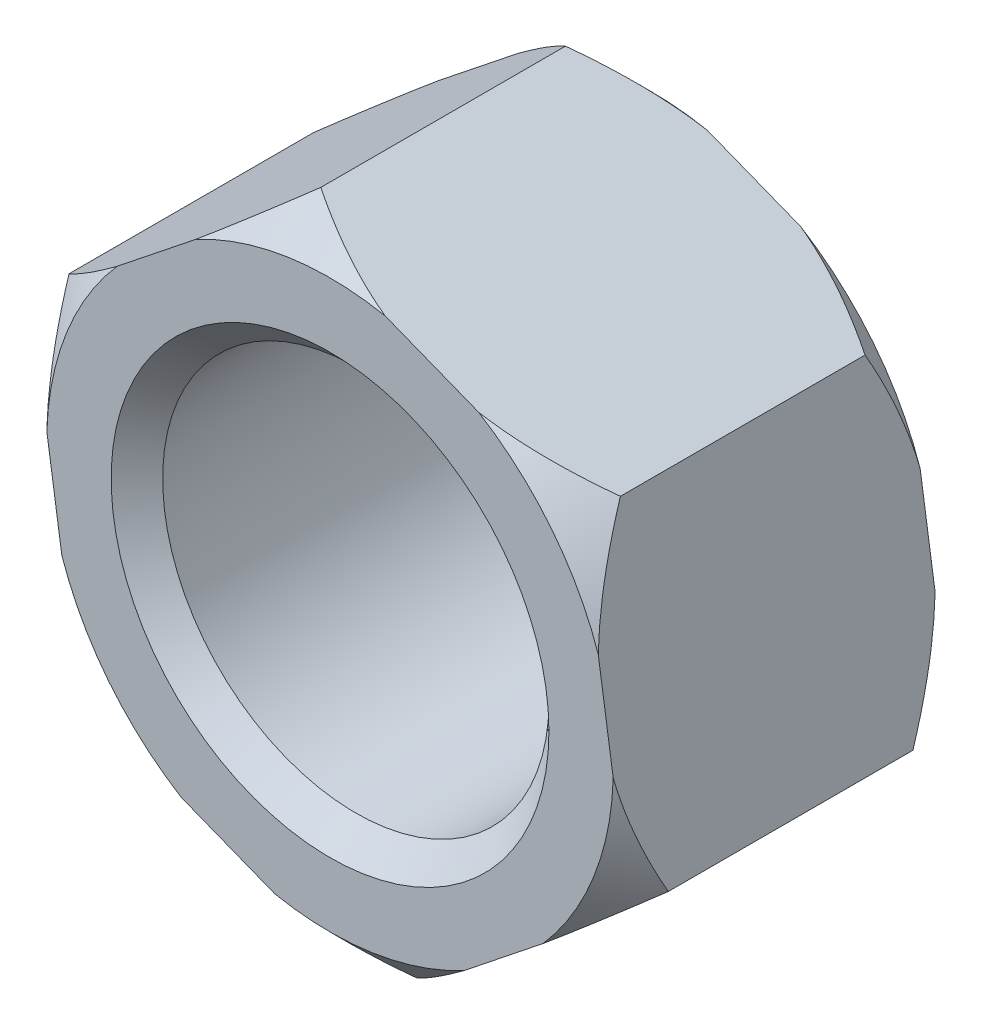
from build123d import *

# Parameters (mm, degrees)
ESQUISSE1_R                  = 2.5
BOSS_EXTRU_1_DEPTH           = 2.5
CHANFREIN1_SIZE              = 0.3
ESQUISSE2_R                  = 1.5
ENL_V_MAT_EXTRU_1_DEPTH      = 5.330127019
CHANFREIN2_SIZE              = 0.2
ENL_V_START                  = -5
ENL_V_MAT_EXTRU_2_DEPTH      = 5
R_P_TITION_CIRCULAIRE1_COUNT = 6


with BuildPart() as part:
    # Esquisse1 → Boss.-Extru.1 (new body)
    with BuildSketch(Plane.XY):
        Circle(ESQUISSE1_R)
    extrude(amount=BOSS_EXTRU_1_DEPTH)

    # Chanfrein1
    chanfrein1_edges = [part.edges().sort_by_distance(p)[0] for p in [
        (-2.5, 0, 0),
        (-2.5, 0, 2.5),
    ]]
    chamfer(chanfrein1_edges, length=CHANFREIN1_SIZE)

    # Esquisse2 → Enl_v. mat.-Extru.1 (cut, through all)
    with BuildSketch(Plane.XY.offset(2.5)):
        Circle(ESQUISSE2_R)
    extrude(amount=-ENL_V_MAT_EXTRU_1_DEPTH, mode=Mode.SUBTRACT)

    # Chanfrein2
    chanfrein2_edges = [part.edges().sort_by_distance(p)[0] for p in [
        (-1.5, 0, 0),
        (-1.5, 0, 2.5),
    ]]
    chamfer(chanfrein2_edges, length=CHANFREIN2_SIZE)

    # Esquisse3 → Enl_v. mat.-Extru.2 (cut)
    with BuildSketch(Plane.XY.offset(2.5).offset(ENL_V_START)):
        with BuildLine():
            Line((-2.326936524, 0.913983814), (-0.37193506, 2.47217805))
            ThreePointArc((-0.37193506, 2.47217805), (-1.558194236, 1.955001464), (-2.326936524, 0.913983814))
        make_face()
    enl_v_mat_extru_2 = extrude(amount=ENL_V_MAT_EXTRU_2_DEPTH, mode=Mode.SUBTRACT)

    # R_p_tition circulaire1: Enl_v. mat.-Extru.2 ×6 about axis
    r_p_tition_circulaire1_axis = Axis((0, 0, 0), (0, 0, 1))
    for i in range(1, R_P_TITION_CIRCULAIRE1_COUNT):
        add(enl_v_mat_extru_2.rotate(r_p_tition_circulaire1_axis, i * 360 / R_P_TITION_CIRCULAIRE1_COUNT), mode=Mode.SUBTRACT)


solid = part.part
